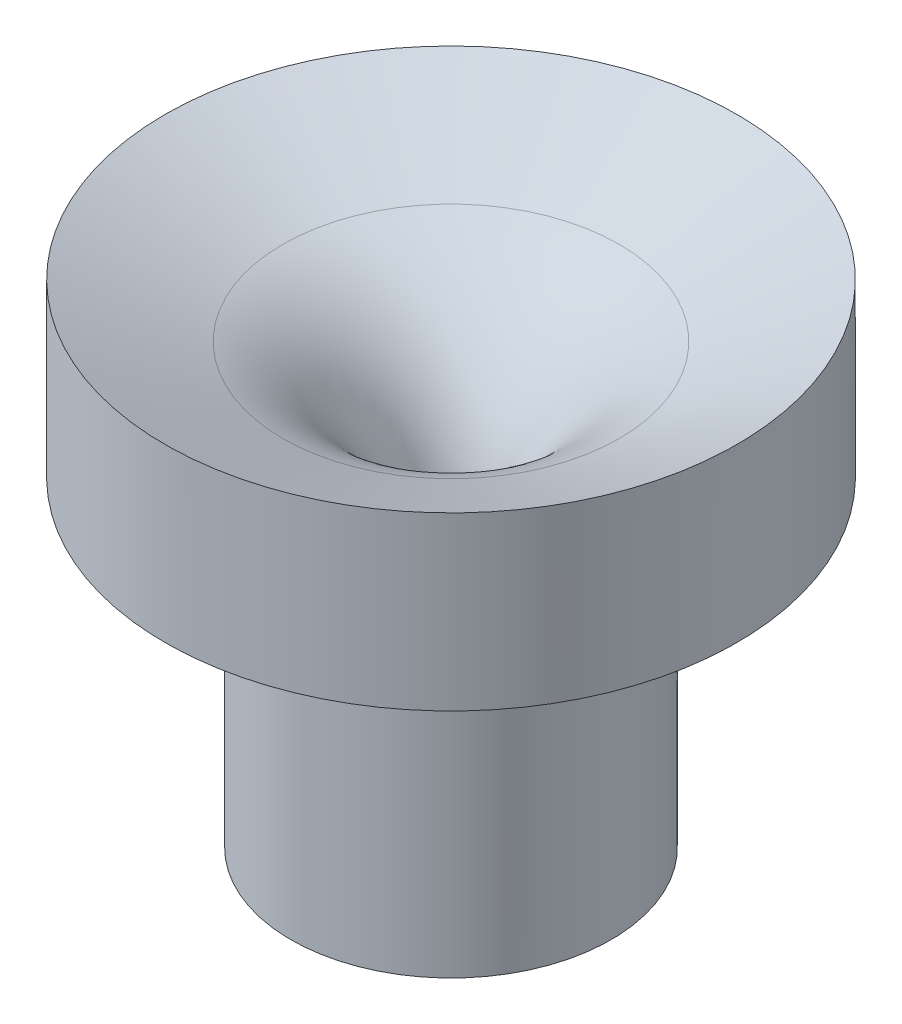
from build123d import *

# Parameters (mm, degrees)
CHAMFER1_SIZE = 2
FILLET1_R     = 10
SKETCH2_W     = 1.5
SKETCH2_H     = 1.5


with BuildPart() as part:
    # Sketch1 → Revolve1 (revolve)
    with BuildSketch(Plane.XY):
        Polygon((12.303737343, 33.55765987), (16.803737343, 33.55765987), (17.803737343, 37.55765987), (17.803737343, 50.044345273), (6.803737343, 55.05765987), (6.803737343, 49.05765987), (8.303737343, 49.05765987), (8.303737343, 47.55765987), (12.303737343, 47.55765987), align=None)
    revolve(axis=Axis((19.303737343, 57.284233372, 0), (0, -1, 0)))

    # Chamfer1
    chamfer1_edges = [part.edges().sort_by_distance(p)[0] for p in [
        (26.303737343, 47.55765987, 0),
    ]]
    chamfer(chamfer1_edges, length=CHAMFER1_SIZE)

    # Fillet1
    fillet1_edges = [part.edges().sort_by_distance(p)[0] for p in [
        (20.803737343, 50.044345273, 0),
    ]]
    fillet(fillet1_edges, radius=FILLET1_R)

    # Sketch2 → Revolve3 (revolve)
    with BuildSketch(Plane.XY):
        with Locations((7.553737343, 48.30765987)):
            Rectangle(SKETCH2_W, SKETCH2_H)
    revolve(axis=Axis((19.303737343, 33.55765987, 0), (0, 1, 0)))


solid = part.part
